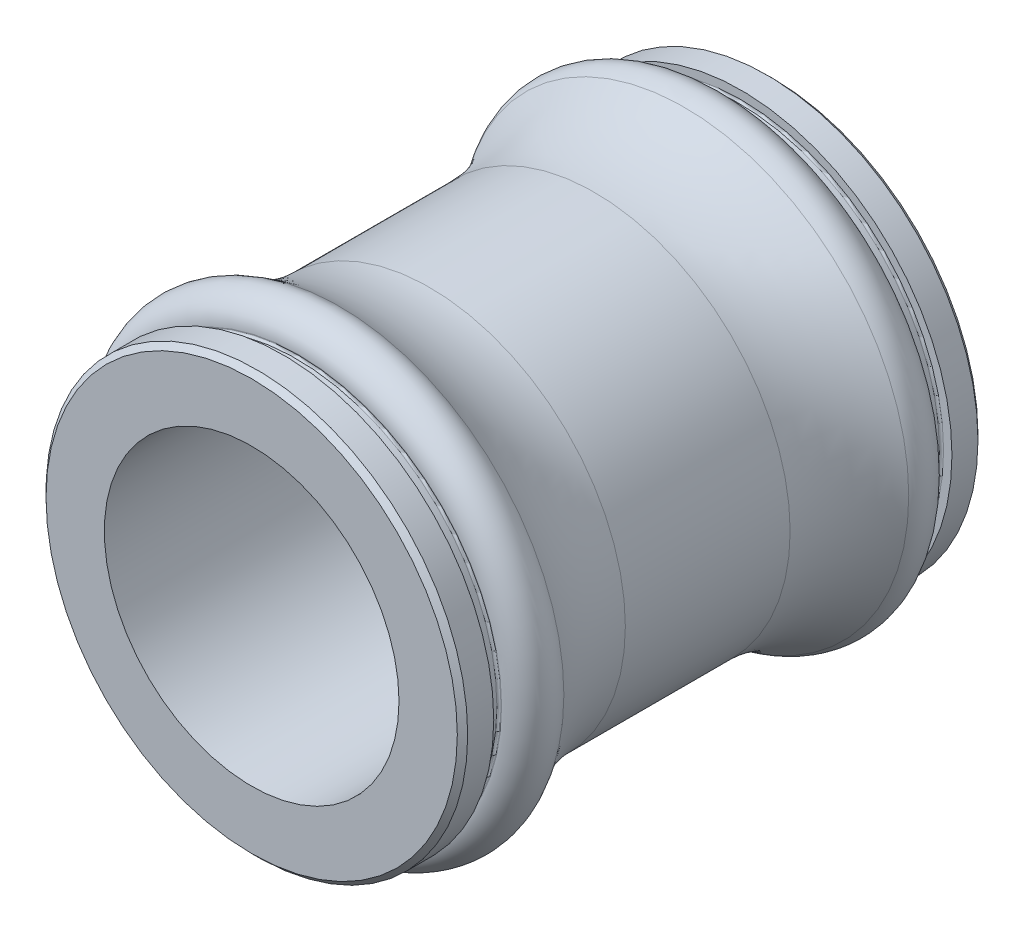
from build123d import *


with BuildPart() as part:
    # Sketch 1 → Revolve 1 (revolve)
    with BuildSketch(Plane(origin=(0, 0, 0), x_dir=(0, 0, -1), z_dir=(1, 0, 0)), mode=Mode.PRIVATE) as revolve_1_sk:
        with BuildLine():
            Line((-50, 14.15), (0, 14.15))
            Line((0, 14.15), (0, 19.75))
            Line((0, 19.75), (-0.5, 20.25))
            Line((-0.5, 20.25), (-3, 20.25))
            Line((-3, 20.25), (-3, 19.45))
            ThreePointArc((-3, 19.45), (-3.058578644, 19.308578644), (-3.2, 19.25))
            Line((-3.2, 19.25), (-4.3, 19.25))
            ThreePointArc((-4.3, 19.25), (-4.441421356, 19.308578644), (-4.5, 19.45))
            Line((-4.5, 19.45), (-4.5, 19.5))
            ThreePointArc((-4.5, 19.5), (-5.849504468, 21.7195405), (-8.441088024, 21.542857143))
            ThreePointArc((-8.441088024, 21.542857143), (-12.552042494, 19.502148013), (-17.08761617, 18.8))
            Line((-17.08761617, 18.8), (-32.91238383, 18.8))
            ThreePointArc((-32.91238383, 18.8), (-37.447957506, 19.502148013), (-41.558911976, 21.542857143))
            ThreePointArc((-41.558911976, 21.542857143), (-44.150495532, 21.7195405), (-45.5, 19.5))
            Line((-45.5, 19.5), (-45.5, 19.45))
            ThreePointArc((-45.5, 19.45), (-45.558578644, 19.308578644), (-45.7, 19.25))
            Line((-45.7, 19.25), (-46.8, 19.25))
            ThreePointArc((-46.8, 19.25), (-46.941421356, 19.308578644), (-47, 19.45))
            Line((-47, 19.45), (-47, 20.25))
            Line((-47, 20.25), (-49.5, 20.25))
            Line((-49.5, 20.25), (-50, 19.75))
            Line((-50, 19.75), (-50, 14.15))
        make_face()
    revolve(revolve_1_sk.sketch.rotate(Axis((0, 0, 0), (0, 0, 1)), 270), axis=Axis((0, 0, 0), (0, 0, 1)))


solid = part.part
